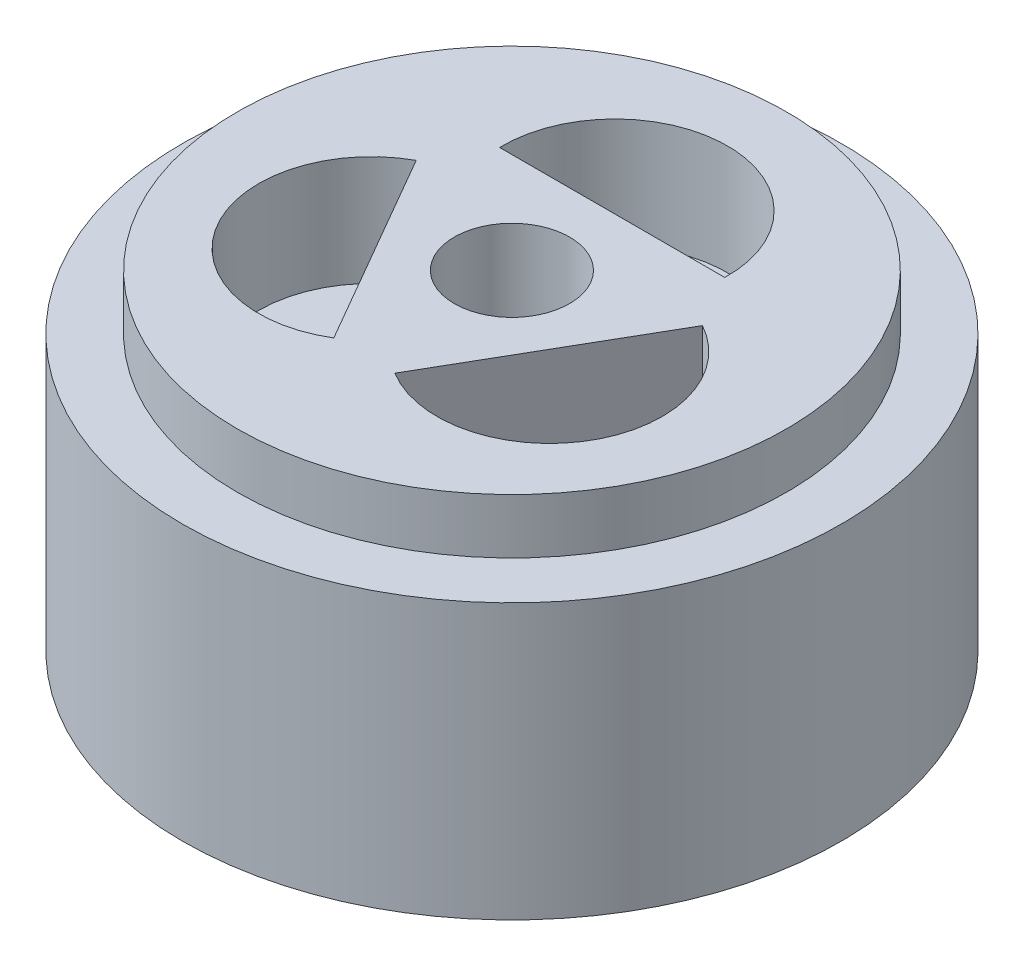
ISO-10303-21;
HEADER;
FILE_DESCRIPTION(('STEP AP214'),'2;1');
FILE_NAME('part.step','',(''),(''),'','','');
FILE_SCHEMA(('AUTOMOTIVE_DESIGN { 1 0 10303 214 1 1 1 1 }'));
ENDSEC;
DATA;
#1=APPLICATION_CONTEXT('core data for automotive mechanical design processes');
#2=APPLICATION_PROTOCOL_DEFINITION('international standard','automotive_design',2000,#1);
#3=PRODUCT_CONTEXT('',#1,'mechanical');
#4=PRODUCT('Part','Part','',(#3));
#5=PRODUCT_RELATED_PRODUCT_CATEGORY('part','',(#4));
#6=PRODUCT_DEFINITION_FORMATION('','',#4);
#7=PRODUCT_DEFINITION_CONTEXT('part definition',#1,'design');
#8=PRODUCT_DEFINITION('design','',#6,#7);
#9=PRODUCT_DEFINITION_SHAPE('','',#8);
#10=(LENGTH_UNIT() NAMED_UNIT(*) SI_UNIT(.MILLI.,.METRE.));
#11=(NAMED_UNIT(*) PLANE_ANGLE_UNIT() SI_UNIT($,.RADIAN.));
#12=(NAMED_UNIT(*) SI_UNIT($,.STERADIAN.) SOLID_ANGLE_UNIT());
#13=UNCERTAINTY_MEASURE_WITH_UNIT(LENGTH_MEASURE(1.E-05),#10,'distance_accuracy_value','');
#14=(GEOMETRIC_REPRESENTATION_CONTEXT(3) GLOBAL_UNCERTAINTY_ASSIGNED_CONTEXT((#13)) GLOBAL_UNIT_ASSIGNED_CONTEXT((#10,
#11,#12)) REPRESENTATION_CONTEXT('',''));
#15=CARTESIAN_POINT('',(0.,0.,0.));
#16=DIRECTION('',(0.,0.,1.));
#17=DIRECTION('',(1.,0.,0.));
#18=AXIS2_PLACEMENT_3D('',#15,#16,#17);
#19=CARTESIAN_POINT('',(0.,10.,0.));
#20=DIRECTION('',(0.,-1.,0.));
#21=DIRECTION('',(0.,0.,-1.));
#22=AXIS2_PLACEMENT_3D('',#19,#20,#21);
#23=CYLINDRICAL_SURFACE('',#22,12.);
#24=CARTESIAN_POINT('',(0.,10.,0.));
#25=DIRECTION('',(0.,1.,0.));
#26=DIRECTION('',(0.,0.,1.));
#27=AXIS2_PLACEMENT_3D('',#24,#25,#26);
#28=CIRCLE('',#27,12.);
#29=CARTESIAN_POINT('',(0.,10.,12.));
#30=VERTEX_POINT('',#29);
#31=EDGE_CURVE('E43',#30,#30,#28,.T.);
#32=ORIENTED_EDGE('',*,*,#31,.F.);
#33=EDGE_LOOP('',(#32));
#34=FACE_BOUND('',#33,.T.);
#35=CARTESIAN_POINT('',(0.,0.,0.));
#36=DIRECTION('',(0.,1.,0.));
#37=DIRECTION('',(0.,0.,1.));
#38=AXIS2_PLACEMENT_3D('',#35,#36,#37);
#39=CIRCLE('',#38,12.);
#40=CARTESIAN_POINT('',(0.,0.,12.));
#41=VERTEX_POINT('',#40);
#42=EDGE_CURVE('E38',#41,#41,#39,.T.);
#43=ORIENTED_EDGE('',*,*,#42,.T.);
#44=EDGE_LOOP('',(#43));
#45=FACE_BOUND('',#44,.T.);
#46=ADVANCED_FACE('F35',(#34,#45),#23,.T.);
#47=CARTESIAN_POINT('',(0.,10.,0.));
#48=DIRECTION('',(0.,1.,0.));
#49=DIRECTION('',(0.,0.,1.));
#50=AXIS2_PLACEMENT_3D('',#47,#48,#49);
#51=PLANE('',#50);
#52=CARTESIAN_POINT('',(0.,10.,0.));
#53=DIRECTION('',(0.,1.,0.));
#54=DIRECTION('',(0.,0.,1.));
#55=AXIS2_PLACEMENT_3D('',#52,#53,#54);
#56=CIRCLE('',#55,10.);
#57=CARTESIAN_POINT('',(0.,10.,10.));
#58=VERTEX_POINT('',#57);
#59=EDGE_CURVE('E11',#58,#58,#56,.T.);
#60=ORIENTED_EDGE('',*,*,#59,.F.);
#61=EDGE_LOOP('',(#60));
#62=FACE_BOUND('',#61,.T.);
#63=ORIENTED_EDGE('',*,*,#31,.T.);
#64=EDGE_LOOP('',(#63));
#65=FACE_BOUND('',#64,.T.);
#66=ADVANCED_FACE('F153',(#62,#65),#51,.T.);
#67=CARTESIAN_POINT('',(0.,0.,0.));
#68=DIRECTION('',(0.,1.,0.));
#69=DIRECTION('',(0.,0.,1.));
#70=AXIS2_PLACEMENT_3D('',#67,#68,#69);
#71=PLANE('',#70);
#72=CARTESIAN_POINT('',(0.,0.,0.));
#73=DIRECTION('',(0.,1.,0.));
#74=DIRECTION('',(0.,0.,1.));
#75=AXIS2_PLACEMENT_3D('',#72,#73,#74);
#76=CIRCLE('',#75,2.1);
#77=CARTESIAN_POINT('',(0.,0.,2.1));
#78=VERTEX_POINT('',#77);
#79=EDGE_CURVE('E136',#78,#78,#76,.T.);
#80=ORIENTED_EDGE('',*,*,#79,.T.);
#81=EDGE_LOOP('',(#80));
#82=FACE_BOUND('',#81,.T.);
#83=ORIENTED_EDGE('',*,*,#42,.F.);
#84=EDGE_LOOP('',(#83));
#85=FACE_BOUND('',#84,.T.);
#86=ADVANCED_FACE('F150',(#82,#85),#71,.F.);
#87=CARTESIAN_POINT('',(0.,12.,0.));
#88=DIRECTION('',(0.,-1.,0.));
#89=DIRECTION('',(0.,0.,-1.));
#90=AXIS2_PLACEMENT_3D('',#87,#88,#89);
#91=CYLINDRICAL_SURFACE('',#90,10.);
#92=CARTESIAN_POINT('',(0.,12.,0.));
#93=DIRECTION('',(0.,1.,0.));
#94=DIRECTION('',(0.,0.,1.));
#95=AXIS2_PLACEMENT_3D('',#92,#93,#94);
#96=CIRCLE('',#95,10.);
#97=CARTESIAN_POINT('',(0.,12.,10.));
#98=VERTEX_POINT('',#97);
#99=EDGE_CURVE('E110',#98,#98,#96,.T.);
#100=ORIENTED_EDGE('',*,*,#99,.F.);
#101=EDGE_LOOP('',(#100));
#102=FACE_BOUND('',#101,.T.);
#103=ORIENTED_EDGE('',*,*,#59,.T.);
#104=EDGE_LOOP('',(#103));
#105=FACE_BOUND('',#104,.T.);
#106=ADVANCED_FACE('F152',(#102,#105),#91,.T.);
#107=CARTESIAN_POINT('',(0.,12.,0.));
#108=DIRECTION('',(0.,1.,0.));
#109=DIRECTION('',(0.,0.,1.));
#110=AXIS2_PLACEMENT_3D('',#107,#108,#109);
#111=PLANE('',#110);
#112=CARTESIAN_POINT('',(0.,12.,0.));
#113=DIRECTION('',(0.,1.,0.));
#114=DIRECTION('',(0.,0.,1.));
#115=AXIS2_PLACEMENT_3D('',#112,#113,#114);
#116=CIRCLE('',#115,2.1);
#117=CARTESIAN_POINT('',(0.,12.,2.1));
#118=VERTEX_POINT('',#117);
#119=EDGE_CURVE('E292',#118,#118,#116,.T.);
#120=ORIENTED_EDGE('',*,*,#119,.F.);
#121=EDGE_LOOP('',(#120));
#122=FACE_BOUND('',#121,.T.);
#123=CARTESIAN_POINT('',(0.,12.,-3.75));
#124=DIRECTION('',(0.,1.,0.));
#125=DIRECTION('',(0.,0.,1.));
#126=AXIS2_PLACEMENT_3D('',#123,#124,#125);
#127=CIRCLE('',#126,4.1);
#128=CARTESIAN_POINT('',(4.09878030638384,12.,-3.65));
#129=VERTEX_POINT('',#128);
#130=CARTESIAN_POINT('',(-4.09878030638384,12.,-3.65));
#131=VERTEX_POINT('',#130);
#132=EDGE_CURVE('E51',#129,#131,#127,.T.);
#133=ORIENTED_EDGE('',*,*,#132,.F.);
#134=DIRECTION('',(1.,0.,0.));
#135=VECTOR('',#134,1.);
#136=CARTESIAN_POINT('',(-4.09878030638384,12.,-3.65));
#137=LINE('',#136,#135);
#138=EDGE_CURVE('E101',#131,#129,#137,.T.);
#139=ORIENTED_EDGE('',*,*,#138,.F.);
#140=EDGE_LOOP('',(#133,#139));
#141=FACE_BOUND('',#140,.T.);
#142=CARTESIAN_POINT('',(3.24759526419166,12.,1.875));
#143=DIRECTION('',(0.,1.,0.));
#144=DIRECTION('',(0.,0.,1.));
#145=AXIS2_PLACEMENT_3D('',#142,#143,#144);
#146=CIRCLE('',#145,4.1);
#147=CARTESIAN_POINT('',(1.11160257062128,12.,5.37464786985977));
#148=VERTEX_POINT('',#147);
#149=CARTESIAN_POINT('',(5.21038287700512,12.,-1.72464786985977));
#150=VERTEX_POINT('',#149);
#151=EDGE_CURVE('E59',#148,#150,#146,.T.);
#152=ORIENTED_EDGE('',*,*,#151,.F.);
#153=DIRECTION('',(-0.5,0.,0.866025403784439));
#154=VECTOR('',#153,1.);
#155=CARTESIAN_POINT('',(5.21038287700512,12.,-1.72464786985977));
#156=LINE('',#155,#154);
#157=EDGE_CURVE('E116',#150,#148,#156,.T.);
#158=ORIENTED_EDGE('',*,*,#157,.F.);
#159=EDGE_LOOP('',(#152,#158));
#160=FACE_BOUND('',#159,.T.);
#161=CARTESIAN_POINT('',(-3.24759526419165,12.,1.87500000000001));
#162=DIRECTION('',(0.,1.,0.));
#163=DIRECTION('',(0.,0.,1.));
#164=AXIS2_PLACEMENT_3D('',#161,#162,#163);
#165=CIRCLE('',#164,4.1);
#166=CARTESIAN_POINT('',(-5.21038287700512,12.,-1.72464786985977));
#167=VERTEX_POINT('',#166);
#168=CARTESIAN_POINT('',(-1.11160257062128,12.,5.37464786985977));
#169=VERTEX_POINT('',#168);
#170=EDGE_CURVE('E134',#167,#169,#165,.T.);
#171=ORIENTED_EDGE('',*,*,#170,.F.);
#172=DIRECTION('',(-0.5,0.,-0.866025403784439));
#173=VECTOR('',#172,1.);
#174=CARTESIAN_POINT('',(-1.11160257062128,12.,5.37464786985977));
#175=LINE('',#174,#173);
#176=EDGE_CURVE('E130',#169,#167,#175,.T.);
#177=ORIENTED_EDGE('',*,*,#176,.F.);
#178=EDGE_LOOP('',(#171,#177));
#179=FACE_BOUND('',#178,.T.);
#180=ORIENTED_EDGE('',*,*,#99,.T.);
#181=EDGE_LOOP('',(#180));
#182=FACE_BOUND('',#181,.T.);
#183=ADVANCED_FACE('F159',(#122,#141,#160,#179,#182),#111,.T.);
#184=CARTESIAN_POINT('',(-3.24759526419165,8.,1.87500000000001));
#185=DIRECTION('',(0.,1.,0.));
#186=DIRECTION('',(0.,0.,1.));
#187=AXIS2_PLACEMENT_3D('',#184,#185,#186);
#188=CYLINDRICAL_SURFACE('',#187,4.1);
#189=ORIENTED_EDGE('',*,*,#170,.T.);
#190=DIRECTION('',(0.,1.,0.));
#191=VECTOR('',#190,1.);
#192=CARTESIAN_POINT('',(-1.11160257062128,8.,5.37464786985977));
#193=LINE('',#192,#191);
#194=CARTESIAN_POINT('',(-1.11160257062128,8.,5.37464786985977));
#195=VERTEX_POINT('',#194);
#196=EDGE_CURVE('E133',#195,#169,#193,.T.);
#197=ORIENTED_EDGE('',*,*,#196,.F.);
#198=CARTESIAN_POINT('',(-3.24759526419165,8.,1.87500000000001));
#199=DIRECTION('',(0.,1.,0.));
#200=DIRECTION('',(0.,0.,1.));
#201=AXIS2_PLACEMENT_3D('',#198,#199,#200);
#202=CIRCLE('',#201,4.1);
#203=CARTESIAN_POINT('',(-5.21038287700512,8.,-1.72464786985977));
#204=VERTEX_POINT('',#203);
#205=EDGE_CURVE('E126',#204,#195,#202,.T.);
#206=ORIENTED_EDGE('',*,*,#205,.F.);
#207=DIRECTION('',(0.,1.,0.));
#208=VECTOR('',#207,1.);
#209=CARTESIAN_POINT('',(-5.21038287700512,8.,-1.72464786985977));
#210=LINE('',#209,#208);
#211=EDGE_CURVE('E121',#204,#167,#210,.T.);
#212=ORIENTED_EDGE('',*,*,#211,.T.);
#213=EDGE_LOOP('',(#189,#197,#206,#212));
#214=FACE_BOUND('',#213,.T.);
#215=ADVANCED_FACE('F187',(#214),#188,.F.);
#216=CARTESIAN_POINT('',(-1.11160257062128,8.,5.37464786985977));
#217=DIRECTION('',(0.866025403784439,0.,-0.5));
#218=DIRECTION('',(-0.5,0.,-0.866025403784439));
#219=AXIS2_PLACEMENT_3D('',#216,#217,#218);
#220=PLANE('',#219);
#221=ORIENTED_EDGE('',*,*,#176,.T.);
#222=ORIENTED_EDGE('',*,*,#211,.F.);
#223=DIRECTION('',(-0.5,0.,-0.866025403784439));
#224=VECTOR('',#223,1.);
#225=CARTESIAN_POINT('',(-1.11160257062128,8.,5.37464786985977));
#226=LINE('',#225,#224);
#227=EDGE_CURVE('E129',#195,#204,#226,.T.);
#228=ORIENTED_EDGE('',*,*,#227,.F.);
#229=ORIENTED_EDGE('',*,*,#196,.T.);
#230=EDGE_LOOP('',(#221,#222,#228,#229));
#231=FACE_BOUND('',#230,.T.);
#232=ADVANCED_FACE('F192',(#231),#220,.F.);
#233=CARTESIAN_POINT('',(-3.24759526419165,8.,1.87500000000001));
#234=DIRECTION('',(0.,1.,0.));
#235=DIRECTION('',(0.,0.,1.));
#236=AXIS2_PLACEMENT_3D('',#233,#234,#235);
#237=PLANE('',#236);
#238=ORIENTED_EDGE('',*,*,#205,.T.);
#239=ORIENTED_EDGE('',*,*,#227,.T.);
#240=EDGE_LOOP('',(#238,#239));
#241=FACE_BOUND('',#240,.T.);
#242=ADVANCED_FACE('F202',(#241),#237,.T.);
#243=CARTESIAN_POINT('',(3.24759526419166,8.,1.875));
#244=DIRECTION('',(0.,1.,0.));
#245=DIRECTION('',(0.,0.,1.));
#246=AXIS2_PLACEMENT_3D('',#243,#244,#245);
#247=CYLINDRICAL_SURFACE('',#246,4.1);
#248=ORIENTED_EDGE('',*,*,#151,.T.);
#249=DIRECTION('',(0.,1.,0.));
#250=VECTOR('',#249,1.);
#251=CARTESIAN_POINT('',(5.21038287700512,8.,-1.72464786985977));
#252=LINE('',#251,#250);
#253=CARTESIAN_POINT('',(5.21038287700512,8.,-1.72464786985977));
#254=VERTEX_POINT('',#253);
#255=EDGE_CURVE('E119',#254,#150,#252,.T.);
#256=ORIENTED_EDGE('',*,*,#255,.F.);
#257=CARTESIAN_POINT('',(3.24759526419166,8.,1.875));
#258=DIRECTION('',(0.,1.,0.));
#259=DIRECTION('',(0.,0.,1.));
#260=AXIS2_PLACEMENT_3D('',#257,#258,#259);
#261=CIRCLE('',#260,4.1);
#262=CARTESIAN_POINT('',(1.11160257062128,8.,5.37464786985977));
#263=VERTEX_POINT('',#262);
#264=EDGE_CURVE('E112',#263,#254,#261,.T.);
#265=ORIENTED_EDGE('',*,*,#264,.F.);
#266=DIRECTION('',(0.,1.,0.));
#267=VECTOR('',#266,1.);
#268=CARTESIAN_POINT('',(1.11160257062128,8.,5.37464786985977));
#269=LINE('',#268,#267);
#270=EDGE_CURVE('E108',#263,#148,#269,.T.);
#271=ORIENTED_EDGE('',*,*,#270,.T.);
#272=EDGE_LOOP('',(#248,#256,#265,#271));
#273=FACE_BOUND('',#272,.T.);
#274=ADVANCED_FACE('F212',(#273),#247,.F.);
#275=CARTESIAN_POINT('',(5.21038287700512,8.,-1.72464786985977));
#276=DIRECTION('',(-0.866025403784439,0.,-0.5));
#277=DIRECTION('',(-0.5,0.,0.866025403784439));
#278=AXIS2_PLACEMENT_3D('',#275,#276,#277);
#279=PLANE('',#278);
#280=ORIENTED_EDGE('',*,*,#157,.T.);
#281=ORIENTED_EDGE('',*,*,#270,.F.);
#282=DIRECTION('',(-0.5,0.,0.866025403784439));
#283=VECTOR('',#282,1.);
#284=CARTESIAN_POINT('',(5.21038287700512,8.,-1.72464786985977));
#285=LINE('',#284,#283);
#286=EDGE_CURVE('E115',#254,#263,#285,.T.);
#287=ORIENTED_EDGE('',*,*,#286,.F.);
#288=ORIENTED_EDGE('',*,*,#255,.T.);
#289=EDGE_LOOP('',(#280,#281,#287,#288));
#290=FACE_BOUND('',#289,.T.);
#291=ADVANCED_FACE('F222',(#290),#279,.F.);
#292=CARTESIAN_POINT('',(3.24759526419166,8.,1.875));
#293=DIRECTION('',(0.,1.,0.));
#294=DIRECTION('',(0.,0.,1.));
#295=AXIS2_PLACEMENT_3D('',#292,#293,#294);
#296=PLANE('',#295);
#297=ORIENTED_EDGE('',*,*,#264,.T.);
#298=ORIENTED_EDGE('',*,*,#286,.T.);
#299=EDGE_LOOP('',(#297,#298));
#300=FACE_BOUND('',#299,.T.);
#301=ADVANCED_FACE('F231',(#300),#296,.T.);
#302=CARTESIAN_POINT('',(0.,8.,-3.75));
#303=DIRECTION('',(0.,1.,0.));
#304=DIRECTION('',(0.,0.,1.));
#305=AXIS2_PLACEMENT_3D('',#302,#303,#304);
#306=CYLINDRICAL_SURFACE('',#305,4.1);
#307=ORIENTED_EDGE('',*,*,#132,.T.);
#308=DIRECTION('',(0.,1.,0.));
#309=VECTOR('',#308,1.);
#310=CARTESIAN_POINT('',(-4.09878030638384,8.,-3.65));
#311=LINE('',#310,#309);
#312=CARTESIAN_POINT('',(-4.09878030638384,8.,-3.65));
#313=VERTEX_POINT('',#312);
#314=EDGE_CURVE('E87',#313,#131,#311,.T.);
#315=ORIENTED_EDGE('',*,*,#314,.F.);
#316=CARTESIAN_POINT('',(0.,8.,-3.75));
#317=DIRECTION('',(0.,1.,0.));
#318=DIRECTION('',(0.,0.,1.));
#319=AXIS2_PLACEMENT_3D('',#316,#317,#318);
#320=CIRCLE('',#319,4.1);
#321=CARTESIAN_POINT('',(4.09878030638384,8.,-3.65));
#322=VERTEX_POINT('',#321);
#323=EDGE_CURVE('E90',#322,#313,#320,.T.);
#324=ORIENTED_EDGE('',*,*,#323,.F.);
#325=DIRECTION('',(0.,1.,0.));
#326=VECTOR('',#325,1.);
#327=CARTESIAN_POINT('',(4.09878030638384,8.,-3.65));
#328=LINE('',#327,#326);
#329=EDGE_CURVE('E96',#322,#129,#328,.T.);
#330=ORIENTED_EDGE('',*,*,#329,.T.);
#331=EDGE_LOOP('',(#307,#315,#324,#330));
#332=FACE_BOUND('',#331,.T.);
#333=ADVANCED_FACE('F89',(#332),#306,.F.);
#334=CARTESIAN_POINT('',(-4.09878030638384,8.,-3.65));
#335=DIRECTION('',(0.,0.,1.));
#336=DIRECTION('',(1.,0.,0.));
#337=AXIS2_PLACEMENT_3D('',#334,#335,#336);
#338=PLANE('',#337);
#339=ORIENTED_EDGE('',*,*,#138,.T.);
#340=ORIENTED_EDGE('',*,*,#329,.F.);
#341=DIRECTION('',(1.,0.,0.));
#342=VECTOR('',#341,1.);
#343=CARTESIAN_POINT('',(-4.09878030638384,8.,-3.65));
#344=LINE('',#343,#342);
#345=EDGE_CURVE('E97',#313,#322,#344,.T.);
#346=ORIENTED_EDGE('',*,*,#345,.F.);
#347=ORIENTED_EDGE('',*,*,#314,.T.);
#348=EDGE_LOOP('',(#339,#340,#346,#347));
#349=FACE_BOUND('',#348,.T.);
#350=ADVANCED_FACE('F103',(#349),#338,.F.);
#351=CARTESIAN_POINT('',(0.,8.,-3.75));
#352=DIRECTION('',(0.,1.,0.));
#353=DIRECTION('',(0.,0.,1.));
#354=AXIS2_PLACEMENT_3D('',#351,#352,#353);
#355=PLANE('',#354);
#356=ORIENTED_EDGE('',*,*,#323,.T.);
#357=ORIENTED_EDGE('',*,*,#345,.T.);
#358=EDGE_LOOP('',(#356,#357));
#359=FACE_BOUND('',#358,.T.);
#360=ADVANCED_FACE('F100',(#359),#355,.T.);
#361=CARTESIAN_POINT('',(0.,-8.,0.));
#362=DIRECTION('',(0.,1.,0.));
#363=DIRECTION('',(0.,0.,1.));
#364=AXIS2_PLACEMENT_3D('',#361,#362,#363);
#365=CYLINDRICAL_SURFACE('',#364,2.1);
#366=ORIENTED_EDGE('',*,*,#119,.T.);
#367=EDGE_LOOP('',(#366));
#368=FACE_BOUND('',#367,.T.);
#369=ORIENTED_EDGE('',*,*,#79,.F.);
#370=EDGE_LOOP('',(#369));
#371=FACE_BOUND('',#370,.T.);
#372=ADVANCED_FACE('F265',(#368,#371),#365,.F.);
#373=CLOSED_SHELL('',(#46,#66,#86,#106,#183,#215,#232,#242,#274,#291,#301,#333,#350,#360,#372));
#374=MANIFOLD_SOLID_BREP('B2',#373);
#375=ADVANCED_BREP_SHAPE_REPRESENTATION('',(#18,#374),#14);
#376=SHAPE_DEFINITION_REPRESENTATION(#9,#375);
ENDSEC;
END-ISO-10303-21;
